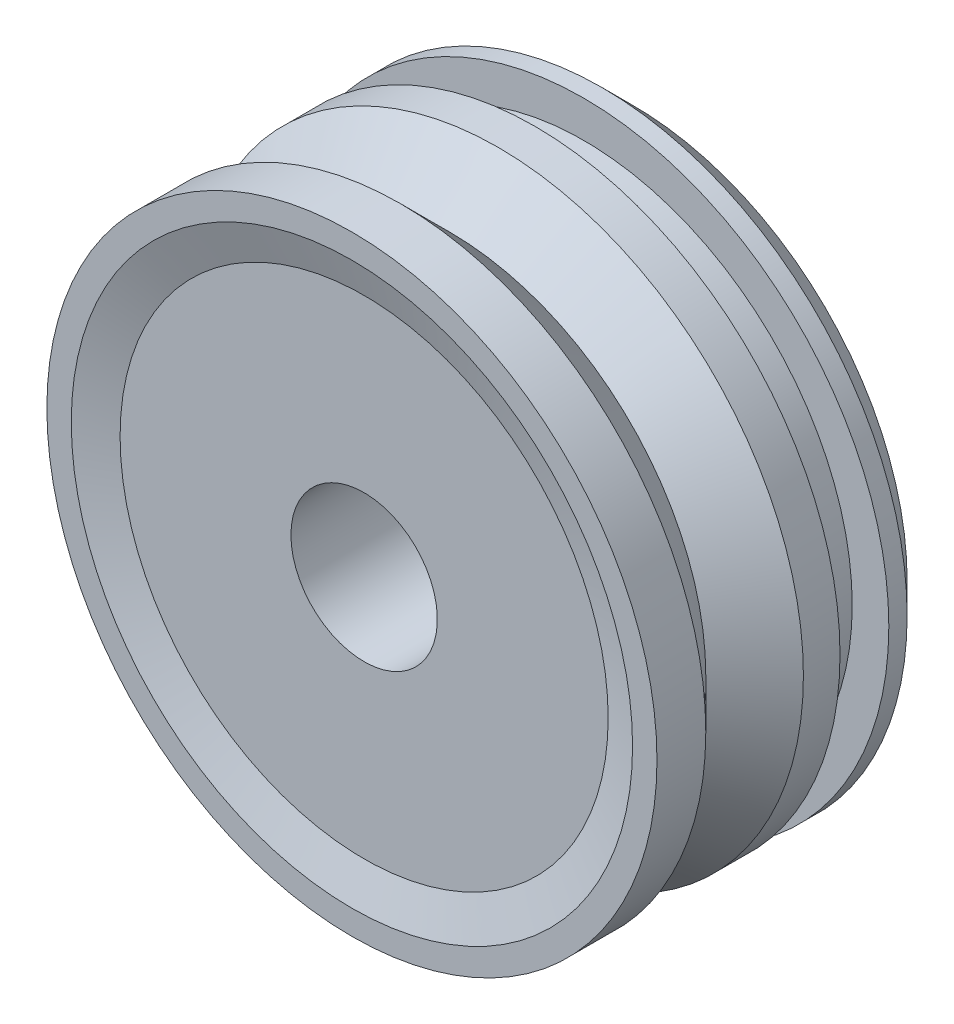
ISO-10303-21;
HEADER;
FILE_DESCRIPTION(('STEP AP214'),'2;1');
FILE_NAME('part.step','',(''),(''),'','','');
FILE_SCHEMA(('AUTOMOTIVE_DESIGN { 1 0 10303 214 1 1 1 1 }'));
ENDSEC;
DATA;
#1=APPLICATION_CONTEXT('core data for automotive mechanical design processes');
#2=APPLICATION_PROTOCOL_DEFINITION('international standard','automotive_design',2000,#1);
#3=PRODUCT_CONTEXT('',#1,'mechanical');
#4=PRODUCT('Part','Part','',(#3));
#5=PRODUCT_RELATED_PRODUCT_CATEGORY('part','',(#4));
#6=PRODUCT_DEFINITION_FORMATION('','',#4);
#7=PRODUCT_DEFINITION_CONTEXT('part definition',#1,'design');
#8=PRODUCT_DEFINITION('design','',#6,#7);
#9=PRODUCT_DEFINITION_SHAPE('','',#8);
#10=(LENGTH_UNIT() NAMED_UNIT(*) SI_UNIT(.MILLI.,.METRE.));
#11=(NAMED_UNIT(*) PLANE_ANGLE_UNIT() SI_UNIT($,.RADIAN.));
#12=(NAMED_UNIT(*) SI_UNIT($,.STERADIAN.) SOLID_ANGLE_UNIT());
#13=UNCERTAINTY_MEASURE_WITH_UNIT(LENGTH_MEASURE(1.E-05),#10,'distance_accuracy_value','');
#14=(GEOMETRIC_REPRESENTATION_CONTEXT(3) GLOBAL_UNCERTAINTY_ASSIGNED_CONTEXT((#13)) GLOBAL_UNIT_ASSIGNED_CONTEXT((#10,
#11,#12)) REPRESENTATION_CONTEXT('',''));
#15=CARTESIAN_POINT('',(0.,0.,0.));
#16=DIRECTION('',(0.,0.,1.));
#17=DIRECTION('',(1.,0.,0.));
#18=AXIS2_PLACEMENT_3D('',#15,#16,#17);
#19=CARTESIAN_POINT('',(0.,0.,11.5));
#20=DIRECTION('',(0.,0.,-1.));
#21=DIRECTION('',(-1.,0.,0.));
#22=AXIS2_PLACEMENT_3D('',#19,#20,#21);
#23=CYLINDRICAL_SURFACE('',#22,12.5);
#24=CARTESIAN_POINT('',(0.,0.,5.50000000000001));
#25=DIRECTION('',(0.,0.,-1.));
#26=DIRECTION('',(-1.,0.,0.));
#27=AXIS2_PLACEMENT_3D('',#24,#25,#26);
#28=CIRCLE('',#27,12.5);
#29=CARTESIAN_POINT('',(-12.5,0.,5.50000000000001));
#30=VERTEX_POINT('',#29);
#31=EDGE_CURVE('E70',#30,#30,#28,.T.);
#32=CARTESIAN_POINT('',(0.,0.,4.));
#33=DIRECTION('',(0.,0.,-1.));
#34=DIRECTION('',(-1.,0.,0.));
#35=AXIS2_PLACEMENT_3D('',#32,#33,#34);
#36=CIRCLE('',#35,12.5);
#37=CARTESIAN_POINT('',(-12.5,0.,4.));
#38=VERTEX_POINT('',#37);
#39=EDGE_CURVE('E55',#38,#38,#36,.T.);
#40=CARTESIAN_POINT('',(-12.5,0.,5.50000000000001));
#41=CARTESIAN_POINT('',(-12.5,0.,5.484375));
#42=CARTESIAN_POINT('',(-12.5,0.,5.46875));
#43=CARTESIAN_POINT('',(-12.5,0.,5.4375));
#44=CARTESIAN_POINT('',(-12.5,0.,5.421875));
#45=CARTESIAN_POINT('',(-12.5,0.,5.390625));
#46=CARTESIAN_POINT('',(-12.5,0.,5.375));
#47=CARTESIAN_POINT('',(-12.5,0.,5.34375));
#48=CARTESIAN_POINT('',(-12.5,0.,5.328125));
#49=CARTESIAN_POINT('',(-12.5,0.,5.296875));
#50=CARTESIAN_POINT('',(-12.5,0.,5.28125));
#51=CARTESIAN_POINT('',(-12.5,0.,5.25));
#52=CARTESIAN_POINT('',(-12.5,0.,5.234375));
#53=CARTESIAN_POINT('',(-12.5,0.,5.203125));
#54=CARTESIAN_POINT('',(-12.5,0.,5.1875));
#55=CARTESIAN_POINT('',(-12.5,0.,5.15625));
#56=CARTESIAN_POINT('',(-12.5,0.,5.140625));
#57=CARTESIAN_POINT('',(-12.5,0.,5.109375));
#58=CARTESIAN_POINT('',(-12.5,0.,5.09375));
#59=CARTESIAN_POINT('',(-12.5,0.,5.0625));
#60=CARTESIAN_POINT('',(-12.5,0.,5.046875));
#61=CARTESIAN_POINT('',(-12.5,0.,5.015625));
#62=CARTESIAN_POINT('',(-12.5,0.,5.));
#63=CARTESIAN_POINT('',(-12.5,0.,4.96875));
#64=CARTESIAN_POINT('',(-12.5,0.,4.953125));
#65=CARTESIAN_POINT('',(-12.5,0.,4.921875));
#66=CARTESIAN_POINT('',(-12.5,0.,4.90625));
#67=CARTESIAN_POINT('',(-12.5,0.,4.875));
#68=CARTESIAN_POINT('',(-12.5,0.,4.859375));
#69=CARTESIAN_POINT('',(-12.5,0.,4.828125));
#70=CARTESIAN_POINT('',(-12.5,0.,4.8125));
#71=CARTESIAN_POINT('',(-12.5,0.,4.78125));
#72=CARTESIAN_POINT('',(-12.5,0.,4.765625));
#73=CARTESIAN_POINT('',(-12.5,0.,4.734375));
#74=CARTESIAN_POINT('',(-12.5,0.,4.71875));
#75=CARTESIAN_POINT('',(-12.5,0.,4.6875));
#76=CARTESIAN_POINT('',(-12.5,0.,4.671875));
#77=CARTESIAN_POINT('',(-12.5,0.,4.640625));
#78=CARTESIAN_POINT('',(-12.5,0.,4.625));
#79=CARTESIAN_POINT('',(-12.5,0.,4.59375));
#80=CARTESIAN_POINT('',(-12.5,0.,4.578125));
#81=CARTESIAN_POINT('',(-12.5,0.,4.546875));
#82=CARTESIAN_POINT('',(-12.5,0.,4.53125));
#83=CARTESIAN_POINT('',(-12.5,0.,4.5));
#84=CARTESIAN_POINT('',(-12.5,0.,4.484375));
#85=CARTESIAN_POINT('',(-12.5,0.,4.453125));
#86=CARTESIAN_POINT('',(-12.5,0.,4.4375));
#87=CARTESIAN_POINT('',(-12.5,0.,4.40625));
#88=CARTESIAN_POINT('',(-12.5,0.,4.390625));
#89=CARTESIAN_POINT('',(-12.5,0.,4.359375));
#90=CARTESIAN_POINT('',(-12.5,0.,4.34375));
#91=CARTESIAN_POINT('',(-12.5,0.,4.3125));
#92=CARTESIAN_POINT('',(-12.5,0.,4.296875));
#93=CARTESIAN_POINT('',(-12.5,0.,4.265625));
#94=CARTESIAN_POINT('',(-12.5,0.,4.25));
#95=CARTESIAN_POINT('',(-12.5,0.,4.21875));
#96=CARTESIAN_POINT('',(-12.5,0.,4.203125));
#97=CARTESIAN_POINT('',(-12.5,0.,4.171875));
#98=CARTESIAN_POINT('',(-12.5,0.,4.15625));
#99=CARTESIAN_POINT('',(-12.5,0.,4.125));
#100=CARTESIAN_POINT('',(-12.5,0.,4.109375));
#101=CARTESIAN_POINT('',(-12.5,0.,4.078125));
#102=CARTESIAN_POINT('',(-12.5,0.,4.0625));
#103=CARTESIAN_POINT('',(-12.5,0.,4.03125));
#104=CARTESIAN_POINT('',(-12.5,0.,4.015625));
#105=CARTESIAN_POINT('',(-12.5,0.,4.));
#106=B_SPLINE_CURVE_WITH_KNOTS('',3,(#40,#41,#42,#43,#44,#45,#46,#47,#48,#49,#50,#51,#52,#53,
#54,#55,#56,#57,#58,#59,#60,#61,#62,#63,#64,#65,#66,#67,#68,#69,#70,#71,#72,#73,#74,#75,#76,#77,
#78,#79,#80,#81,#82,#83,#84,#85,#86,#87,#88,#89,#90,#91,#92,#93,#94,#95,#96,#97,#98,#99,#100,
#101,#102,#103,#104,#105),.UNSPECIFIED.,.F.,.F.,(4,2,2,2,2,2,2,2,2,2,2,2,2,2,2,2,2,2,2,2,2,2,2,
2,2,2,2,2,2,2,2,2,4),(0.,0.046875,0.0937500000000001,0.140625,0.1875,0.234375,0.28125,0.328125,
0.375,0.421875,0.46875,0.515625,0.5625,0.609375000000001,0.656250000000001,0.703125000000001,
0.750000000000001,0.796875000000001,0.843750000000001,0.890625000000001,0.937500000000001,
0.984375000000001,1.03125,1.078125,1.125,1.171875,1.21875,1.265625,1.3125,1.359375,1.40625,
1.453125,1.5),.UNSPECIFIED.);
#107=EDGE_CURVE('BSEAM26',#30,#38,#106,.T.);
#108=ORIENTED_EDGE('',*,*,#31,.T.);
#109=ORIENTED_EDGE('',*,*,#39,.F.);
#110=ORIENTED_EDGE('',*,*,#107,.T.);
#111=ORIENTED_EDGE('',*,*,#107,.F.);
#112=EDGE_LOOP('',(#108,#110,#109,#111));
#113=FACE_BOUND('',#112,.T.);
#114=ADVANCED_FACE('F26',(#113),#23,.T.);
#115=CARTESIAN_POINT('',(-12.5,0.,4.));
#116=DIRECTION('',(0.,0.,1.));
#117=DIRECTION('',(1.,0.,0.));
#118=AXIS2_PLACEMENT_3D('',#115,#116,#117);
#119=PLANE('',#118);
#120=CARTESIAN_POINT('',(0.,0.,4.));
#121=DIRECTION('',(0.,0.,-1.));
#122=DIRECTION('',(-1.,0.,0.));
#123=AXIS2_PLACEMENT_3D('',#120,#121,#122);
#124=CIRCLE('',#123,11.);
#125=CARTESIAN_POINT('',(-11.,0.,4.));
#126=VERTEX_POINT('',#125);
#127=EDGE_CURVE('E58',#126,#126,#124,.T.);
#128=ORIENTED_EDGE('',*,*,#127,.F.);
#129=EDGE_LOOP('',(#128));
#130=FACE_BOUND('',#129,.T.);
#131=ORIENTED_EDGE('',*,*,#39,.T.);
#132=EDGE_LOOP('',(#131));
#133=FACE_BOUND('',#132,.T.);
#134=ADVANCED_FACE('F114',(#130,#133),#119,.F.);
#135=CARTESIAN_POINT('',(0.,0.,-3.39865377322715));
#136=DIRECTION('',(0.,0.,-1.));
#137=DIRECTION('',(-1.,0.,0.));
#138=AXIS2_PLACEMENT_3D('',#135,#136,#137);
#139=CYLINDRICAL_SURFACE('',#138,11.);
#140=CARTESIAN_POINT('',(0.,0.,2.));
#141=DIRECTION('',(0.,0.,-1.));
#142=DIRECTION('',(-1.,0.,0.));
#143=AXIS2_PLACEMENT_3D('',#140,#141,#142);
#144=CIRCLE('',#143,11.);
#145=CARTESIAN_POINT('',(-11.,0.,2.));
#146=VERTEX_POINT('',#145);
#147=EDGE_CURVE('E61',#146,#146,#144,.T.);
#148=CARTESIAN_POINT('',(-11.,0.,2.));
#149=CARTESIAN_POINT('',(-11.,0.,2.02083333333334));
#150=CARTESIAN_POINT('',(-11.,0.,2.04166666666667));
#151=CARTESIAN_POINT('',(-11.,0.,2.08333333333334));
#152=CARTESIAN_POINT('',(-11.,0.,2.10416666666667));
#153=CARTESIAN_POINT('',(-11.,0.,2.14583333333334));
#154=CARTESIAN_POINT('',(-11.,0.,2.16666666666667));
#155=CARTESIAN_POINT('',(-11.,0.,2.20833333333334));
#156=CARTESIAN_POINT('',(-11.,0.,2.22916666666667));
#157=CARTESIAN_POINT('',(-11.,0.,2.27083333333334));
#158=CARTESIAN_POINT('',(-11.,0.,2.29166666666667));
#159=CARTESIAN_POINT('',(-11.,0.,2.33333333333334));
#160=CARTESIAN_POINT('',(-11.,0.,2.35416666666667));
#161=CARTESIAN_POINT('',(-11.,0.,2.39583333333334));
#162=CARTESIAN_POINT('',(-11.,0.,2.41666666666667));
#163=CARTESIAN_POINT('',(-11.,0.,2.45833333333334));
#164=CARTESIAN_POINT('',(-11.,0.,2.47916666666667));
#165=CARTESIAN_POINT('',(-11.,0.,2.52083333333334));
#166=CARTESIAN_POINT('',(-11.,0.,2.54166666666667));
#167=CARTESIAN_POINT('',(-11.,0.,2.58333333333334));
#168=CARTESIAN_POINT('',(-11.,0.,2.60416666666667));
#169=CARTESIAN_POINT('',(-11.,0.,2.64583333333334));
#170=CARTESIAN_POINT('',(-11.,0.,2.66666666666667));
#171=CARTESIAN_POINT('',(-11.,0.,2.70833333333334));
#172=CARTESIAN_POINT('',(-11.,0.,2.72916666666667));
#173=CARTESIAN_POINT('',(-11.,0.,2.77083333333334));
#174=CARTESIAN_POINT('',(-11.,0.,2.79166666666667));
#175=CARTESIAN_POINT('',(-11.,0.,2.83333333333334));
#176=CARTESIAN_POINT('',(-11.,0.,2.85416666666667));
#177=CARTESIAN_POINT('',(-11.,0.,2.89583333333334));
#178=CARTESIAN_POINT('',(-11.,0.,2.91666666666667));
#179=CARTESIAN_POINT('',(-11.,0.,2.95833333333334));
#180=CARTESIAN_POINT('',(-11.,0.,2.97916666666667));
#181=CARTESIAN_POINT('',(-11.,0.,3.02083333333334));
#182=CARTESIAN_POINT('',(-11.,0.,3.04166666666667));
#183=CARTESIAN_POINT('',(-11.,0.,3.08333333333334));
#184=CARTESIAN_POINT('',(-11.,0.,3.10416666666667));
#185=CARTESIAN_POINT('',(-11.,0.,3.14583333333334));
#186=CARTESIAN_POINT('',(-11.,0.,3.16666666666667));
#187=CARTESIAN_POINT('',(-11.,0.,3.20833333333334));
#188=CARTESIAN_POINT('',(-11.,0.,3.22916666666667));
#189=CARTESIAN_POINT('',(-11.,0.,3.27083333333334));
#190=CARTESIAN_POINT('',(-11.,0.,3.29166666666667));
#191=CARTESIAN_POINT('',(-11.,0.,3.33333333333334));
#192=CARTESIAN_POINT('',(-11.,0.,3.35416666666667));
#193=CARTESIAN_POINT('',(-11.,0.,3.39583333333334));
#194=CARTESIAN_POINT('',(-11.,0.,3.41666666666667));
#195=CARTESIAN_POINT('',(-11.,0.,3.45833333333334));
#196=CARTESIAN_POINT('',(-11.,0.,3.47916666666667));
#197=CARTESIAN_POINT('',(-11.,0.,3.52083333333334));
#198=CARTESIAN_POINT('',(-11.,0.,3.54166666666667));
#199=CARTESIAN_POINT('',(-11.,0.,3.58333333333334));
#200=CARTESIAN_POINT('',(-11.,0.,3.60416666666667));
#201=CARTESIAN_POINT('',(-11.,0.,3.64583333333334));
#202=CARTESIAN_POINT('',(-11.,0.,3.66666666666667));
#203=CARTESIAN_POINT('',(-11.,0.,3.70833333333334));
#204=CARTESIAN_POINT('',(-11.,0.,3.72916666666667));
#205=CARTESIAN_POINT('',(-11.,0.,3.77083333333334));
#206=CARTESIAN_POINT('',(-11.,0.,3.79166666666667));
#207=CARTESIAN_POINT('',(-11.,0.,3.83333333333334));
#208=CARTESIAN_POINT('',(-11.,0.,3.85416666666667));
#209=CARTESIAN_POINT('',(-11.,0.,3.89583333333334));
#210=CARTESIAN_POINT('',(-11.,0.,3.91666666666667));
#211=CARTESIAN_POINT('',(-11.,0.,3.95833333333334));
#212=CARTESIAN_POINT('',(-11.,0.,3.97916666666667));
#213=CARTESIAN_POINT('',(-11.,0.,4.));
#214=B_SPLINE_CURVE_WITH_KNOTS('',3,(#148,#149,#150,#151,#152,#153,#154,#155,#156,#157,#158,
#159,#160,#161,#162,#163,#164,#165,#166,#167,#168,#169,#170,#171,#172,#173,#174,#175,#176,#177,
#178,#179,#180,#181,#182,#183,#184,#185,#186,#187,#188,#189,#190,#191,#192,#193,#194,#195,#196,
#197,#198,#199,#200,#201,#202,#203,#204,#205,#206,#207,#208,#209,#210,#211,#212,#213),
.UNSPECIFIED.,.F.,.F.,(4,2,2,2,2,2,2,2,2,2,2,2,2,2,2,2,2,2,2,2,2,2,2,2,2,2,2,2,2,2,2,2,4),(0.,
0.0625000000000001,0.125,0.1875,0.25,0.3125,0.375,0.4375,0.5,0.5625,0.625,0.6875,0.75,0.8125,
0.875,0.9375,1.,1.0625,1.125,1.1875,1.25,1.3125,1.375,1.4375,1.5,1.5625,1.625,1.6875,1.75,
1.8125,1.875,1.9375,2.),.UNSPECIFIED.);
#215=EDGE_CURVE('BSEAM120',#146,#126,#214,.T.);
#216=ORIENTED_EDGE('',*,*,#147,.F.);
#217=ORIENTED_EDGE('',*,*,#127,.T.);
#218=ORIENTED_EDGE('',*,*,#215,.T.);
#219=ORIENTED_EDGE('',*,*,#215,.F.);
#220=EDGE_LOOP('',(#216,#218,#217,#219));
#221=FACE_BOUND('',#220,.T.);
#222=ADVANCED_FACE('F120',(#221),#139,.T.);
#223=CARTESIAN_POINT('',(-12.5,0.,2.));
#224=DIRECTION('',(0.,0.,-1.));
#225=DIRECTION('',(-1.,0.,0.));
#226=AXIS2_PLACEMENT_3D('',#223,#224,#225);
#227=PLANE('',#226);
#228=CARTESIAN_POINT('',(0.,0.,2.));
#229=DIRECTION('',(0.,0.,-1.));
#230=DIRECTION('',(-1.,0.,0.));
#231=AXIS2_PLACEMENT_3D('',#228,#229,#230);
#232=CIRCLE('',#231,12.5);
#233=CARTESIAN_POINT('',(-12.5,0.,2.));
#234=VERTEX_POINT('',#233);
#235=EDGE_CURVE('E64',#234,#234,#232,.T.);
#236=ORIENTED_EDGE('',*,*,#235,.F.);
#237=EDGE_LOOP('',(#236));
#238=FACE_BOUND('',#237,.T.);
#239=ORIENTED_EDGE('',*,*,#147,.T.);
#240=EDGE_LOOP('',(#239));
#241=FACE_BOUND('',#240,.T.);
#242=ADVANCED_FACE('F111',(#238,#241),#227,.F.);
#243=CARTESIAN_POINT('',(0.,0.,0.));
#244=DIRECTION('',(0.,0.,1.));
#245=DIRECTION('',(1.,0.,0.));
#246=AXIS2_PLACEMENT_3D('',#243,#244,#245);
#247=PLANE('',#246);
#248=CARTESIAN_POINT('',(0.,0.,0.));
#249=DIRECTION('',(0.,0.,-1.));
#250=DIRECTION('',(-1.,0.,0.));
#251=AXIS2_PLACEMENT_3D('',#248,#249,#250);
#252=CIRCLE('',#251,9.5);
#253=CARTESIAN_POINT('',(-9.50000000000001,0.,0.));
#254=VERTEX_POINT('',#253);
#255=EDGE_CURVE('E79',#254,#254,#252,.T.);
#256=ORIENTED_EDGE('',*,*,#255,.F.);
#257=EDGE_LOOP('',(#256));
#258=FACE_BOUND('',#257,.T.);
#259=CARTESIAN_POINT('',(0.,0.,0.));
#260=DIRECTION('',(0.,0.,1.));
#261=DIRECTION('',(1.,0.,0.));
#262=AXIS2_PLACEMENT_3D('',#259,#260,#261);
#263=CIRCLE('',#262,11.25);
#264=CARTESIAN_POINT('',(11.25,0.,0.));
#265=VERTEX_POINT('',#264);
#266=EDGE_CURVE('E37',#265,#265,#263,.F.);
#267=ORIENTED_EDGE('',*,*,#266,.T.);
#268=EDGE_LOOP('',(#267));
#269=FACE_BOUND('',#268,.T.);
#270=ADVANCED_FACE('F99',(#258,#269),#247,.F.);
#271=CARTESIAN_POINT('',(0.,0.,1.25));
#272=DIRECTION('',(0.,0.,1.));
#273=DIRECTION('',(1.,0.,0.));
#274=AXIS2_PLACEMENT_3D('',#271,#272,#273);
#275=CONICAL_SURFACE('',#274,12.5,0.78539816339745);
#276=CARTESIAN_POINT('',(0.,0.,1.25));
#277=DIRECTION('',(0.,0.,1.));
#278=DIRECTION('',(1.,0.,0.));
#279=AXIS2_PLACEMENT_3D('',#276,#277,#278);
#280=CIRCLE('',#279,12.5);
#281=CARTESIAN_POINT('',(12.5,0.,1.25));
#282=VERTEX_POINT('',#281);
#283=EDGE_CURVE('E41',#282,#282,#280,.T.);
#284=CARTESIAN_POINT('',(11.25,0.,0.));
#285=CARTESIAN_POINT('',(11.2630208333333,0.,0.0130208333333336));
#286=CARTESIAN_POINT('',(11.2760416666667,0.,0.0260416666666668));
#287=CARTESIAN_POINT('',(11.3020833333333,0.,0.0520833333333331));
#288=CARTESIAN_POINT('',(11.3151041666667,0.,0.0651041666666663));
#289=CARTESIAN_POINT('',(11.3411458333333,0.,0.0911458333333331));
#290=CARTESIAN_POINT('',(11.3541666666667,0.,0.104166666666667));
#291=CARTESIAN_POINT('',(11.3802083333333,0.,0.130208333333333));
#292=CARTESIAN_POINT('',(11.3932291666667,0.,0.143229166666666));
#293=CARTESIAN_POINT('',(11.4192708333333,0.,0.169270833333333));
#294=CARTESIAN_POINT('',(11.4322916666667,0.,0.182291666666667));
#295=CARTESIAN_POINT('',(11.4583333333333,0.,0.208333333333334));
#296=CARTESIAN_POINT('',(11.4713541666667,0.,0.221354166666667));
#297=CARTESIAN_POINT('',(11.4973958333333,0.,0.247395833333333));
#298=CARTESIAN_POINT('',(11.5104166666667,0.,0.260416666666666));
#299=CARTESIAN_POINT('',(11.5364583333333,0.,0.286458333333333));
#300=CARTESIAN_POINT('',(11.5494791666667,0.,0.299479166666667));
#301=CARTESIAN_POINT('',(11.5755208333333,0.,0.325520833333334));
#302=CARTESIAN_POINT('',(11.5885416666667,0.,0.338541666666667));
#303=CARTESIAN_POINT('',(11.6145833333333,0.,0.364583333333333));
#304=CARTESIAN_POINT('',(11.6276041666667,0.,0.377604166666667));
#305=CARTESIAN_POINT('',(11.6536458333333,0.,0.403645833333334));
#306=CARTESIAN_POINT('',(11.6666666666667,0.,0.416666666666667));
#307=CARTESIAN_POINT('',(11.6927083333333,0.,0.442708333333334));
#308=CARTESIAN_POINT('',(11.7057291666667,0.,0.455729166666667));
#309=CARTESIAN_POINT('',(11.7317708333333,0.,0.481770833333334));
#310=CARTESIAN_POINT('',(11.7447916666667,0.,0.494791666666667));
#311=CARTESIAN_POINT('',(11.7708333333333,0.,0.520833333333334));
#312=CARTESIAN_POINT('',(11.7838541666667,0.,0.533854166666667));
#313=CARTESIAN_POINT('',(11.8098958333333,0.,0.559895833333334));
#314=CARTESIAN_POINT('',(11.8229166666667,0.,0.572916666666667));
#315=CARTESIAN_POINT('',(11.8489583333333,0.,0.598958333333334));
#316=CARTESIAN_POINT('',(11.8619791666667,0.,0.611979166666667));
#317=CARTESIAN_POINT('',(11.8880208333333,0.,0.638020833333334));
#318=CARTESIAN_POINT('',(11.9010416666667,0.,0.651041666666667));
#319=CARTESIAN_POINT('',(11.9270833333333,0.,0.677083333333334));
#320=CARTESIAN_POINT('',(11.9401041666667,0.,0.690104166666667));
#321=CARTESIAN_POINT('',(11.9661458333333,0.,0.716145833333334));
#322=CARTESIAN_POINT('',(11.9791666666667,0.,0.729166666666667));
#323=CARTESIAN_POINT('',(12.0052083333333,0.,0.755208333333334));
#324=CARTESIAN_POINT('',(12.0182291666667,0.,0.768229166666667));
#325=CARTESIAN_POINT('',(12.0442708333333,0.,0.794270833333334));
#326=CARTESIAN_POINT('',(12.0572916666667,0.,0.807291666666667));
#327=CARTESIAN_POINT('',(12.0833333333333,0.,0.833333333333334));
#328=CARTESIAN_POINT('',(12.0963541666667,0.,0.846354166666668));
#329=CARTESIAN_POINT('',(12.1223958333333,0.,0.872395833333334));
#330=CARTESIAN_POINT('',(12.1354166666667,0.,0.885416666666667));
#331=CARTESIAN_POINT('',(12.1614583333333,0.,0.911458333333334));
#332=CARTESIAN_POINT('',(12.1744791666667,0.,0.924479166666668));
#333=CARTESIAN_POINT('',(12.2005208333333,0.,0.950520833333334));
#334=CARTESIAN_POINT('',(12.2135416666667,0.,0.963541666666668));
#335=CARTESIAN_POINT('',(12.2395833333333,0.,0.989583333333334));
#336=CARTESIAN_POINT('',(12.2526041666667,0.,1.00260416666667));
#337=CARTESIAN_POINT('',(12.2786458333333,0.,1.02864583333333));
#338=CARTESIAN_POINT('',(12.2916666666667,0.,1.04166666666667));
#339=CARTESIAN_POINT('',(12.3177083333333,0.,1.06770833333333));
#340=CARTESIAN_POINT('',(12.3307291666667,0.,1.08072916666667));
#341=CARTESIAN_POINT('',(12.3567708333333,0.,1.10677083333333));
#342=CARTESIAN_POINT('',(12.3697916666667,0.,1.11979166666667));
#343=CARTESIAN_POINT('',(12.3958333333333,0.,1.14583333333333));
#344=CARTESIAN_POINT('',(12.4088541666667,0.,1.15885416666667));
#345=CARTESIAN_POINT('',(12.4348958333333,0.,1.18489583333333));
#346=CARTESIAN_POINT('',(12.4479166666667,0.,1.19791666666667));
#347=CARTESIAN_POINT('',(12.4739583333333,0.,1.22395833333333));
#348=CARTESIAN_POINT('',(12.4869791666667,0.,1.23697916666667));
#349=CARTESIAN_POINT('',(12.5,0.,1.25));
#350=B_SPLINE_CURVE_WITH_KNOTS('',3,(#284,#285,#286,#287,#288,#289,#290,#291,#292,#293,#294,
#295,#296,#297,#298,#299,#300,#301,#302,#303,#304,#305,#306,#307,#308,#309,#310,#311,#312,#313,
#314,#315,#316,#317,#318,#319,#320,#321,#322,#323,#324,#325,#326,#327,#328,#329,#330,#331,#332,
#333,#334,#335,#336,#337,#338,#339,#340,#341,#342,#343,#344,#345,#346,#347,#348,#349),
.UNSPECIFIED.,.F.,.F.,(4,2,2,2,2,2,2,2,2,2,2,2,2,2,2,2,2,2,2,2,2,2,2,2,2,2,2,2,2,2,2,2,4),(0.,
0.0552427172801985,0.110485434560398,0.165728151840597,0.220970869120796,0.276213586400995,
0.331456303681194,0.386699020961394,0.441941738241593,0.497184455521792,0.552427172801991,
0.607669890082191,0.66291260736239,0.71815532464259,0.77339804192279,0.828640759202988,
0.883883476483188,0.939126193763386,0.994368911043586,1.04961162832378,1.10485434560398,
1.16009706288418,1.21533978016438,1.27058249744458,1.32582521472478,1.38106793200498,
1.43631064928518,1.49155336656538,1.54679608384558,1.60203880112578,1.65728151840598,
1.71252423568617,1.76776695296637),.UNSPECIFIED.);
#351=EDGE_CURVE('BSEAM110',#265,#282,#350,.T.);
#352=ORIENTED_EDGE('',*,*,#266,.F.);
#353=ORIENTED_EDGE('',*,*,#283,.F.);
#354=ORIENTED_EDGE('',*,*,#351,.T.);
#355=ORIENTED_EDGE('',*,*,#351,.F.);
#356=EDGE_LOOP('',(#352,#354,#353,#355));
#357=FACE_BOUND('',#356,.T.);
#358=ADVANCED_FACE('F110',(#357),#275,.T.);
#359=ORIENTED_EDGE('',*,*,#235,.T.);
#360=EDGE_LOOP('',(#359));
#361=FACE_BOUND('',#360,.T.);
#362=ORIENTED_EDGE('',*,*,#283,.T.);
#363=EDGE_LOOP('',(#362));
#364=FACE_BOUND('',#363,.T.);
#365=ADVANCED_FACE('F28',(#361,#364),#23,.T.);
#366=CARTESIAN_POINT('',(0.,0.,9.50000000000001));
#367=DIRECTION('',(0.,0.,1.));
#368=DIRECTION('',(1.,0.,0.));
#369=AXIS2_PLACEMENT_3D('',#366,#367,#368);
#370=CONICAL_SURFACE('',#369,12.5,0.785398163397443);
#371=CARTESIAN_POINT('',(0.,0.,7.49999999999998));
#372=DIRECTION('',(0.,0.,-1.));
#373=DIRECTION('',(-1.,0.,0.));
#374=AXIS2_PLACEMENT_3D('',#371,#372,#373);
#375=CIRCLE('',#374,10.5);
#376=CARTESIAN_POINT('',(10.5,0.,7.49999999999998));
#377=VERTEX_POINT('',#376);
#378=EDGE_CURVE('E67',#377,#377,#375,.T.);
#379=CARTESIAN_POINT('',(0.,0.,9.50000000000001));
#380=DIRECTION('',(0.,0.,-1.));
#381=DIRECTION('',(-1.,0.,0.));
#382=AXIS2_PLACEMENT_3D('',#379,#380,#381);
#383=CIRCLE('',#382,12.5);
#384=CARTESIAN_POINT('',(12.5,0.,9.50000000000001));
#385=VERTEX_POINT('',#384);
#386=EDGE_CURVE('E73',#385,#385,#383,.T.);
#387=CARTESIAN_POINT('',(10.5,0.,7.49999999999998));
#388=CARTESIAN_POINT('',(10.5208333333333,0.,7.52083333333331));
#389=CARTESIAN_POINT('',(10.5416666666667,0.,7.54166666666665));
#390=CARTESIAN_POINT('',(10.5833333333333,0.,7.58333333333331));
#391=CARTESIAN_POINT('',(10.6041666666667,0.,7.60416666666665));
#392=CARTESIAN_POINT('',(10.6458333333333,0.,7.64583333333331));
#393=CARTESIAN_POINT('',(10.6666666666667,0.,7.66666666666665));
#394=CARTESIAN_POINT('',(10.7083333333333,0.,7.70833333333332));
#395=CARTESIAN_POINT('',(10.7291666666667,0.,7.72916666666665));
#396=CARTESIAN_POINT('',(10.7708333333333,0.,7.77083333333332));
#397=CARTESIAN_POINT('',(10.7916666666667,0.,7.79166666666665));
#398=CARTESIAN_POINT('',(10.8333333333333,0.,7.83333333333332));
#399=CARTESIAN_POINT('',(10.8541666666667,0.,7.85416666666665));
#400=CARTESIAN_POINT('',(10.8958333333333,0.,7.89583333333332));
#401=CARTESIAN_POINT('',(10.9166666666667,0.,7.91666666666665));
#402=CARTESIAN_POINT('',(10.9583333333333,0.,7.95833333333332));
#403=CARTESIAN_POINT('',(10.9791666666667,0.,7.97916666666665));
#404=CARTESIAN_POINT('',(11.0208333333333,0.,8.02083333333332));
#405=CARTESIAN_POINT('',(11.0416666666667,0.,8.04166666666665));
#406=CARTESIAN_POINT('',(11.0833333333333,0.,8.08333333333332));
#407=CARTESIAN_POINT('',(11.1041666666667,0.,8.10416666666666));
#408=CARTESIAN_POINT('',(11.1458333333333,0.,8.14583333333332));
#409=CARTESIAN_POINT('',(11.1666666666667,0.,8.16666666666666));
#410=CARTESIAN_POINT('',(11.2083333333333,0.,8.20833333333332));
#411=CARTESIAN_POINT('',(11.2291666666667,0.,8.22916666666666));
#412=CARTESIAN_POINT('',(11.2708333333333,0.,8.27083333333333));
#413=CARTESIAN_POINT('',(11.2916666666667,0.,8.29166666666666));
#414=CARTESIAN_POINT('',(11.3333333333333,0.,8.33333333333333));
#415=CARTESIAN_POINT('',(11.3541666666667,0.,8.35416666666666));
#416=CARTESIAN_POINT('',(11.3958333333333,0.,8.39583333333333));
#417=CARTESIAN_POINT('',(11.4166666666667,0.,8.41666666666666));
#418=CARTESIAN_POINT('',(11.4583333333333,0.,8.45833333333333));
#419=CARTESIAN_POINT('',(11.4791666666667,0.,8.47916666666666));
#420=CARTESIAN_POINT('',(11.5208333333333,0.,8.52083333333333));
#421=CARTESIAN_POINT('',(11.5416666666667,0.,8.54166666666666));
#422=CARTESIAN_POINT('',(11.5833333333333,0.,8.58333333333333));
#423=CARTESIAN_POINT('',(11.6041666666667,0.,8.60416666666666));
#424=CARTESIAN_POINT('',(11.6458333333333,0.,8.64583333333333));
#425=CARTESIAN_POINT('',(11.6666666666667,0.,8.66666666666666));
#426=CARTESIAN_POINT('',(11.7083333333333,0.,8.70833333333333));
#427=CARTESIAN_POINT('',(11.7291666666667,0.,8.72916666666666));
#428=CARTESIAN_POINT('',(11.7708333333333,0.,8.77083333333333));
#429=CARTESIAN_POINT('',(11.7916666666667,0.,8.79166666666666));
#430=CARTESIAN_POINT('',(11.8333333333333,0.,8.83333333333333));
#431=CARTESIAN_POINT('',(11.8541666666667,0.,8.85416666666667));
#432=CARTESIAN_POINT('',(11.8958333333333,0.,8.89583333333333));
#433=CARTESIAN_POINT('',(11.9166666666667,0.,8.91666666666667));
#434=CARTESIAN_POINT('',(11.9583333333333,0.,8.95833333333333));
#435=CARTESIAN_POINT('',(11.9791666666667,0.,8.97916666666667));
#436=CARTESIAN_POINT('',(12.0208333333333,0.,9.02083333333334));
#437=CARTESIAN_POINT('',(12.0416666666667,0.,9.04166666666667));
#438=CARTESIAN_POINT('',(12.0833333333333,0.,9.08333333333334));
#439=CARTESIAN_POINT('',(12.1041666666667,0.,9.10416666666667));
#440=CARTESIAN_POINT('',(12.1458333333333,0.,9.14583333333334));
#441=CARTESIAN_POINT('',(12.1666666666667,0.,9.16666666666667));
#442=CARTESIAN_POINT('',(12.2083333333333,0.,9.20833333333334));
#443=CARTESIAN_POINT('',(12.2291666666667,0.,9.22916666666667));
#444=CARTESIAN_POINT('',(12.2708333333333,0.,9.27083333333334));
#445=CARTESIAN_POINT('',(12.2916666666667,0.,9.29166666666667));
#446=CARTESIAN_POINT('',(12.3333333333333,0.,9.33333333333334));
#447=CARTESIAN_POINT('',(12.3541666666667,0.,9.35416666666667));
#448=CARTESIAN_POINT('',(12.3958333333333,0.,9.39583333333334));
#449=CARTESIAN_POINT('',(12.4166666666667,0.,9.41666666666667));
#450=CARTESIAN_POINT('',(12.4583333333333,0.,9.45833333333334));
#451=CARTESIAN_POINT('',(12.4791666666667,0.,9.47916666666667));
#452=CARTESIAN_POINT('',(12.5,0.,9.50000000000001));
#453=B_SPLINE_CURVE_WITH_KNOTS('',3,(#387,#388,#389,#390,#391,#392,#393,#394,#395,#396,#397,
#398,#399,#400,#401,#402,#403,#404,#405,#406,#407,#408,#409,#410,#411,#412,#413,#414,#415,#416,
#417,#418,#419,#420,#421,#422,#423,#424,#425,#426,#427,#428,#429,#430,#431,#432,#433,#434,#435,
#436,#437,#438,#439,#440,#441,#442,#443,#444,#445,#446,#447,#448,#449,#450,#451,#452),
.UNSPECIFIED.,.F.,.F.,(4,2,2,2,2,2,2,2,2,2,2,2,2,2,2,2,2,2,2,2,2,2,2,2,2,2,2,2,2,2,2,2,4),(0.,
0.0883883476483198,0.176776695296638,0.265165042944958,0.353553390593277,0.441941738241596,
0.530330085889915,0.618718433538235,0.707106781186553,0.795495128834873,0.883883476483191,
0.972271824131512,1.06066017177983,1.14904851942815,1.23743686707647,1.32582521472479,
1.41421356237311,1.50260191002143,1.59099025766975,1.67937860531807,1.76776695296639,
1.85615530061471,1.94454364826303,2.03293199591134,2.12132034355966,2.20970869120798,
2.2980970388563,2.38648538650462,2.47487373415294,2.56326208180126,2.65165042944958,
2.7400387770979,2.82842712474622),.UNSPECIFIED.);
#454=EDGE_CURVE('BSEAM125',#377,#385,#453,.T.);
#455=ORIENTED_EDGE('',*,*,#378,.F.);
#456=ORIENTED_EDGE('',*,*,#386,.T.);
#457=ORIENTED_EDGE('',*,*,#454,.T.);
#458=ORIENTED_EDGE('',*,*,#454,.F.);
#459=EDGE_LOOP('',(#455,#457,#456,#458));
#460=FACE_BOUND('',#459,.T.);
#461=ADVANCED_FACE('F125',(#460),#370,.T.);
#462=CARTESIAN_POINT('',(0.,0.,7.49999999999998));
#463=DIRECTION('',(0.,0.,-1.));
#464=DIRECTION('',(-1.,0.,0.));
#465=AXIS2_PLACEMENT_3D('',#462,#463,#464);
#466=CONICAL_SURFACE('',#465,10.5,0.785398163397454);
#467=ORIENTED_EDGE('',*,*,#31,.F.);
#468=EDGE_LOOP('',(#467));
#469=FACE_BOUND('',#468,.T.);
#470=ORIENTED_EDGE('',*,*,#378,.T.);
#471=EDGE_LOOP('',(#470));
#472=FACE_BOUND('',#471,.T.);
#473=ADVANCED_FACE('F145',(#469,#472),#466,.T.);
#474=CARTESIAN_POINT('',(0.,0.,11.));
#475=DIRECTION('',(0.,0.,1.));
#476=DIRECTION('',(1.,0.,0.));
#477=AXIS2_PLACEMENT_3D('',#474,#475,#476);
#478=PLANE('',#477);
#479=CARTESIAN_POINT('',(0.,0.,11.));
#480=DIRECTION('',(0.,0.,1.));
#481=DIRECTION('',(1.,0.,0.));
#482=AXIS2_PLACEMENT_3D('',#479,#480,#481);
#483=CIRCLE('',#482,3.);
#484=CARTESIAN_POINT('',(-3.,0.,11.));
#485=VERTEX_POINT('',#484);
#486=EDGE_CURVE('E85',#485,#485,#483,.T.);
#487=ORIENTED_EDGE('',*,*,#486,.F.);
#488=EDGE_LOOP('',(#487));
#489=FACE_BOUND('',#488,.T.);
#490=CARTESIAN_POINT('',(0.,0.,11.));
#491=DIRECTION('',(0.,0.,1.));
#492=DIRECTION('',(1.,0.,0.));
#493=AXIS2_PLACEMENT_3D('',#490,#491,#492);
#494=CIRCLE('',#493,10.);
#495=CARTESIAN_POINT('',(10.,0.,11.));
#496=VERTEX_POINT('',#495);
#497=EDGE_CURVE('E52',#496,#496,#494,.T.);
#498=ORIENTED_EDGE('',*,*,#497,.T.);
#499=EDGE_LOOP('',(#498));
#500=FACE_BOUND('',#499,.T.);
#501=ADVANCED_FACE('F151',(#489,#500),#478,.T.);
#502=CARTESIAN_POINT('',(0.,0.,11.));
#503=DIRECTION('',(0.,0.,1.));
#504=DIRECTION('',(1.,0.,0.));
#505=AXIS2_PLACEMENT_3D('',#502,#503,#504);
#506=CONICAL_SURFACE('',#505,10.,1.24904577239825);
#507=CARTESIAN_POINT('',(0.,0.,11.5));
#508=DIRECTION('',(0.,0.,1.));
#509=DIRECTION('',(1.,0.,0.));
#510=AXIS2_PLACEMENT_3D('',#507,#508,#509);
#511=CIRCLE('',#510,11.5);
#512=CARTESIAN_POINT('',(11.5,0.,11.5));
#513=VERTEX_POINT('',#512);
#514=EDGE_CURVE('E49',#513,#513,#511,.T.);
#515=CARTESIAN_POINT('',(11.5,0.,11.5));
#516=CARTESIAN_POINT('',(11.484375,0.,11.4947916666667));
#517=CARTESIAN_POINT('',(11.46875,0.,11.4895833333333));
#518=CARTESIAN_POINT('',(11.4375,0.,11.4791666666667));
#519=CARTESIAN_POINT('',(11.421875,0.,11.4739583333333));
#520=CARTESIAN_POINT('',(11.390625,0.,11.4635416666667));
#521=CARTESIAN_POINT('',(11.375,0.,11.4583333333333));
#522=CARTESIAN_POINT('',(11.34375,0.,11.4479166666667));
#523=CARTESIAN_POINT('',(11.328125,0.,11.4427083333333));
#524=CARTESIAN_POINT('',(11.296875,0.,11.4322916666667));
#525=CARTESIAN_POINT('',(11.28125,0.,11.4270833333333));
#526=CARTESIAN_POINT('',(11.25,0.,11.4166666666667));
#527=CARTESIAN_POINT('',(11.234375,0.,11.4114583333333));
#528=CARTESIAN_POINT('',(11.203125,0.,11.4010416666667));
#529=CARTESIAN_POINT('',(11.1875,0.,11.3958333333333));
#530=CARTESIAN_POINT('',(11.15625,0.,11.3854166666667));
#531=CARTESIAN_POINT('',(11.140625,0.,11.3802083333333));
#532=CARTESIAN_POINT('',(11.109375,0.,11.3697916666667));
#533=CARTESIAN_POINT('',(11.09375,0.,11.3645833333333));
#534=CARTESIAN_POINT('',(11.0625,0.,11.3541666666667));
#535=CARTESIAN_POINT('',(11.046875,0.,11.3489583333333));
#536=CARTESIAN_POINT('',(11.015625,0.,11.3385416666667));
#537=CARTESIAN_POINT('',(11.,0.,11.3333333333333));
#538=CARTESIAN_POINT('',(10.96875,0.,11.3229166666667));
#539=CARTESIAN_POINT('',(10.953125,0.,11.3177083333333));
#540=CARTESIAN_POINT('',(10.921875,0.,11.3072916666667));
#541=CARTESIAN_POINT('',(10.90625,0.,11.3020833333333));
#542=CARTESIAN_POINT('',(10.875,0.,11.2916666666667));
#543=CARTESIAN_POINT('',(10.859375,0.,11.2864583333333));
#544=CARTESIAN_POINT('',(10.828125,0.,11.2760416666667));
#545=CARTESIAN_POINT('',(10.8125,0.,11.2708333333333));
#546=CARTESIAN_POINT('',(10.78125,0.,11.2604166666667));
#547=CARTESIAN_POINT('',(10.765625,0.,11.2552083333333));
#548=CARTESIAN_POINT('',(10.734375,0.,11.2447916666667));
#549=CARTESIAN_POINT('',(10.71875,0.,11.2395833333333));
#550=CARTESIAN_POINT('',(10.6875,0.,11.2291666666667));
#551=CARTESIAN_POINT('',(10.671875,0.,11.2239583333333));
#552=CARTESIAN_POINT('',(10.640625,0.,11.2135416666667));
#553=CARTESIAN_POINT('',(10.625,0.,11.2083333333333));
#554=CARTESIAN_POINT('',(10.59375,0.,11.1979166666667));
#555=CARTESIAN_POINT('',(10.578125,0.,11.1927083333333));
#556=CARTESIAN_POINT('',(10.546875,0.,11.1822916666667));
#557=CARTESIAN_POINT('',(10.53125,0.,11.1770833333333));
#558=CARTESIAN_POINT('',(10.5,0.,11.1666666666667));
#559=CARTESIAN_POINT('',(10.484375,0.,11.1614583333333));
#560=CARTESIAN_POINT('',(10.453125,0.,11.1510416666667));
#561=CARTESIAN_POINT('',(10.4375,0.,11.1458333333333));
#562=CARTESIAN_POINT('',(10.40625,0.,11.1354166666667));
#563=CARTESIAN_POINT('',(10.390625,0.,11.1302083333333));
#564=CARTESIAN_POINT('',(10.359375,0.,11.1197916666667));
#565=CARTESIAN_POINT('',(10.34375,0.,11.1145833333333));
#566=CARTESIAN_POINT('',(10.3125,0.,11.1041666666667));
#567=CARTESIAN_POINT('',(10.296875,0.,11.0989583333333));
#568=CARTESIAN_POINT('',(10.265625,0.,11.0885416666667));
#569=CARTESIAN_POINT('',(10.25,0.,11.0833333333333));
#570=CARTESIAN_POINT('',(10.21875,0.,11.0729166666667));
#571=CARTESIAN_POINT('',(10.203125,0.,11.0677083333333));
#572=CARTESIAN_POINT('',(10.171875,0.,11.0572916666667));
#573=CARTESIAN_POINT('',(10.15625,0.,11.0520833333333));
#574=CARTESIAN_POINT('',(10.125,0.,11.0416666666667));
#575=CARTESIAN_POINT('',(10.109375,0.,11.0364583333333));
#576=CARTESIAN_POINT('',(10.078125,0.,11.0260416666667));
#577=CARTESIAN_POINT('',(10.0625,0.,11.0208333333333));
#578=CARTESIAN_POINT('',(10.03125,0.,11.0104166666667));
#579=CARTESIAN_POINT('',(10.015625,0.,11.0052083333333));
#580=CARTESIAN_POINT('',(10.,0.,11.));
#581=B_SPLINE_CURVE_WITH_KNOTS('',3,(#515,#516,#517,#518,#519,#520,#521,#522,#523,#524,#525,
#526,#527,#528,#529,#530,#531,#532,#533,#534,#535,#536,#537,#538,#539,#540,#541,#542,#543,#544,
#545,#546,#547,#548,#549,#550,#551,#552,#553,#554,#555,#556,#557,#558,#559,#560,#561,#562,#563,
#564,#565,#566,#567,#568,#569,#570,#571,#572,#573,#574,#575,#576,#577,#578,#579,#580),
.UNSPECIFIED.,.F.,.F.,(4,2,2,2,2,2,2,2,2,2,2,2,2,2,2,2,2,2,2,2,2,2,2,2,2,2,2,2,2,2,2,2,4),(0.,
0.0494105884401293,0.098821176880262,0.148231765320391,0.197642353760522,0.247052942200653,
0.296463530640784,0.345874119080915,0.395284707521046,0.444695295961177,0.494105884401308,
0.543516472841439,0.59292706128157,0.642337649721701,0.691748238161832,0.741158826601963,
0.790569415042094,0.839980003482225,0.889390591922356,0.938801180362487,0.988211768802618,
1.03762235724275,1.08703294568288,1.13644353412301,1.18585412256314,1.23526471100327,
1.2846752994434,1.33408588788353,1.38349647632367,1.4329070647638,1.48231765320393,
1.53172824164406,1.58113883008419),.UNSPECIFIED.);
#582=EDGE_CURVE('BSEAM137',#513,#496,#581,.T.);
#583=ORIENTED_EDGE('',*,*,#514,.T.);
#584=ORIENTED_EDGE('',*,*,#497,.F.);
#585=ORIENTED_EDGE('',*,*,#582,.T.);
#586=ORIENTED_EDGE('',*,*,#582,.F.);
#587=EDGE_LOOP('',(#583,#585,#584,#586));
#588=FACE_BOUND('',#587,.T.);
#589=ADVANCED_FACE('F137',(#588),#506,.F.);
#590=CARTESIAN_POINT('',(0.,0.,11.5));
#591=DIRECTION('',(0.,0.,1.));
#592=DIRECTION('',(1.,0.,0.));
#593=AXIS2_PLACEMENT_3D('',#590,#591,#592);
#594=PLANE('',#593);
#595=ORIENTED_EDGE('',*,*,#514,.F.);
#596=EDGE_LOOP('',(#595));
#597=FACE_BOUND('',#596,.T.);
#598=CARTESIAN_POINT('',(0.,0.,11.5));
#599=DIRECTION('',(0.,0.,1.));
#600=DIRECTION('',(1.,0.,0.));
#601=AXIS2_PLACEMENT_3D('',#598,#599,#600);
#602=CIRCLE('',#601,12.5);
#603=CARTESIAN_POINT('',(12.5,0.,11.5));
#604=VERTEX_POINT('',#603);
#605=EDGE_CURVE('E46',#604,#604,#602,.T.);
#606=ORIENTED_EDGE('',*,*,#605,.T.);
#607=EDGE_LOOP('',(#606));
#608=FACE_BOUND('',#607,.T.);
#609=ADVANCED_FACE('F129',(#597,#608),#594,.T.);
#610=ORIENTED_EDGE('',*,*,#386,.F.);
#611=EDGE_LOOP('',(#610));
#612=FACE_BOUND('',#611,.T.);
#613=ORIENTED_EDGE('',*,*,#605,.F.);
#614=EDGE_LOOP('',(#613));
#615=FACE_BOUND('',#614,.T.);
#616=ADVANCED_FACE('F116',(#612,#615),#23,.T.);
#617=CARTESIAN_POINT('',(0.,0.,6.00000000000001));
#618=DIRECTION('',(0.,0.,-1.));
#619=DIRECTION('',(-1.,0.,0.));
#620=AXIS2_PLACEMENT_3D('',#617,#618,#619);
#621=CYLINDRICAL_SURFACE('',#620,9.5);
#622=CARTESIAN_POINT('',(0.,0.,6.00000000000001));
#623=DIRECTION('',(0.,0.,-1.));
#624=DIRECTION('',(-1.,0.,0.));
#625=AXIS2_PLACEMENT_3D('',#622,#623,#624);
#626=CIRCLE('',#625,9.5);
#627=CARTESIAN_POINT('',(-9.50000000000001,0.,6.00000000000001));
#628=VERTEX_POINT('',#627);
#629=EDGE_CURVE('E76',#628,#628,#626,.T.);
#630=CARTESIAN_POINT('',(-9.50000000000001,0.,6.00000000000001));
#631=CARTESIAN_POINT('',(-9.50000000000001,0.,5.93750000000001));
#632=CARTESIAN_POINT('',(-9.50000000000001,0.,5.87500000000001));
#633=CARTESIAN_POINT('',(-9.50000000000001,0.,5.75000000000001));
#634=CARTESIAN_POINT('',(-9.50000000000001,0.,5.68750000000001));
#635=CARTESIAN_POINT('',(-9.50000000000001,0.,5.56250000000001));
#636=CARTESIAN_POINT('',(-9.50000000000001,0.,5.50000000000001));
#637=CARTESIAN_POINT('',(-9.50000000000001,0.,5.375));
#638=CARTESIAN_POINT('',(-9.50000000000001,0.,5.3125));
#639=CARTESIAN_POINT('',(-9.50000000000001,0.,5.1875));
#640=CARTESIAN_POINT('',(-9.50000000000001,0.,5.125));
#641=CARTESIAN_POINT('',(-9.50000000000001,0.,5.));
#642=CARTESIAN_POINT('',(-9.50000000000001,0.,4.9375));
#643=CARTESIAN_POINT('',(-9.50000000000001,0.,4.8125));
#644=CARTESIAN_POINT('',(-9.50000000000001,0.,4.75));
#645=CARTESIAN_POINT('',(-9.50000000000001,0.,4.625));
#646=CARTESIAN_POINT('',(-9.50000000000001,0.,4.5625));
#647=CARTESIAN_POINT('',(-9.50000000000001,0.,4.4375));
#648=CARTESIAN_POINT('',(-9.50000000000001,0.,4.375));
#649=CARTESIAN_POINT('',(-9.50000000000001,0.,4.25));
#650=CARTESIAN_POINT('',(-9.50000000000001,0.,4.1875));
#651=CARTESIAN_POINT('',(-9.50000000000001,0.,4.0625));
#652=CARTESIAN_POINT('',(-9.50000000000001,0.,4.));
#653=CARTESIAN_POINT('',(-9.50000000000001,0.,3.875));
#654=CARTESIAN_POINT('',(-9.50000000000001,0.,3.8125));
#655=CARTESIAN_POINT('',(-9.50000000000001,0.,3.6875));
#656=CARTESIAN_POINT('',(-9.50000000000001,0.,3.625));
#657=CARTESIAN_POINT('',(-9.50000000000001,0.,3.5));
#658=CARTESIAN_POINT('',(-9.50000000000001,0.,3.4375));
#659=CARTESIAN_POINT('',(-9.50000000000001,0.,3.3125));
#660=CARTESIAN_POINT('',(-9.50000000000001,0.,3.25));
#661=CARTESIAN_POINT('',(-9.50000000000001,0.,3.125));
#662=CARTESIAN_POINT('',(-9.50000000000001,0.,3.0625));
#663=CARTESIAN_POINT('',(-9.50000000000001,0.,2.9375));
#664=CARTESIAN_POINT('',(-9.50000000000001,0.,2.875));
#665=CARTESIAN_POINT('',(-9.50000000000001,0.,2.75));
#666=CARTESIAN_POINT('',(-9.50000000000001,0.,2.6875));
#667=CARTESIAN_POINT('',(-9.50000000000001,0.,2.5625));
#668=CARTESIAN_POINT('',(-9.50000000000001,0.,2.5));
#669=CARTESIAN_POINT('',(-9.50000000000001,0.,2.375));
#670=CARTESIAN_POINT('',(-9.50000000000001,0.,2.3125));
#671=CARTESIAN_POINT('',(-9.50000000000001,0.,2.1875));
#672=CARTESIAN_POINT('',(-9.50000000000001,0.,2.125));
#673=CARTESIAN_POINT('',(-9.50000000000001,0.,2.));
#674=CARTESIAN_POINT('',(-9.50000000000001,0.,1.9375));
#675=CARTESIAN_POINT('',(-9.50000000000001,0.,1.8125));
#676=CARTESIAN_POINT('',(-9.50000000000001,0.,1.75));
#677=CARTESIAN_POINT('',(-9.50000000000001,0.,1.625));
#678=CARTESIAN_POINT('',(-9.50000000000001,0.,1.5625));
#679=CARTESIAN_POINT('',(-9.50000000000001,0.,1.4375));
#680=CARTESIAN_POINT('',(-9.50000000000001,0.,1.375));
#681=CARTESIAN_POINT('',(-9.50000000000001,0.,1.25));
#682=CARTESIAN_POINT('',(-9.50000000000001,0.,1.1875));
#683=CARTESIAN_POINT('',(-9.50000000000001,0.,1.0625));
#684=CARTESIAN_POINT('',(-9.50000000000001,0.,1.));
#685=CARTESIAN_POINT('',(-9.50000000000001,0.,0.875));
#686=CARTESIAN_POINT('',(-9.50000000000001,0.,0.8125));
#687=CARTESIAN_POINT('',(-9.50000000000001,0.,0.6875));
#688=CARTESIAN_POINT('',(-9.50000000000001,0.,0.625));
#689=CARTESIAN_POINT('',(-9.50000000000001,0.,0.5));
#690=CARTESIAN_POINT('',(-9.50000000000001,0.,0.4375));
#691=CARTESIAN_POINT('',(-9.50000000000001,0.,0.312499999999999));
#692=CARTESIAN_POINT('',(-9.50000000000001,0.,0.249999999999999));
#693=CARTESIAN_POINT('',(-9.50000000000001,0.,0.125));
#694=CARTESIAN_POINT('',(-9.50000000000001,0.,0.0624999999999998));
#695=CARTESIAN_POINT('',(-9.50000000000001,0.,0.));
#696=B_SPLINE_CURVE_WITH_KNOTS('',3,(#630,#631,#632,#633,#634,#635,#636,#637,#638,#639,#640,
#641,#642,#643,#644,#645,#646,#647,#648,#649,#650,#651,#652,#653,#654,#655,#656,#657,#658,#659,
#660,#661,#662,#663,#664,#665,#666,#667,#668,#669,#670,#671,#672,#673,#674,#675,#676,#677,#678,
#679,#680,#681,#682,#683,#684,#685,#686,#687,#688,#689,#690,#691,#692,#693,#694,#695),
.UNSPECIFIED.,.F.,.F.,(4,2,2,2,2,2,2,2,2,2,2,2,2,2,2,2,2,2,2,2,2,2,2,2,2,2,2,2,2,2,2,2,4),(0.,
0.187500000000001,0.375000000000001,0.562500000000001,0.750000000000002,0.937500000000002,1.125,
1.3125,1.5,1.6875,1.875,2.0625,2.25,2.4375,2.625,2.8125,3.,3.1875,3.375,3.5625,3.75,3.9375,
4.125,4.3125,4.5,4.68750000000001,4.87500000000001,5.06250000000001,5.25000000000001,
5.43750000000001,5.62500000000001,5.81250000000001,6.00000000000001),.UNSPECIFIED.);
#697=EDGE_CURVE('BSEAM128',#628,#254,#696,.T.);
#698=ORIENTED_EDGE('',*,*,#629,.F.);
#699=ORIENTED_EDGE('',*,*,#255,.T.);
#700=ORIENTED_EDGE('',*,*,#697,.T.);
#701=ORIENTED_EDGE('',*,*,#697,.F.);
#702=EDGE_LOOP('',(#698,#700,#699,#701));
#703=FACE_BOUND('',#702,.T.);
#704=ADVANCED_FACE('F128',(#703),#621,.F.);
#705=CARTESIAN_POINT('',(0.,0.,6.00000000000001));
#706=DIRECTION('',(0.,0.,-1.));
#707=DIRECTION('',(-1.,0.,0.));
#708=AXIS2_PLACEMENT_3D('',#705,#706,#707);
#709=PLANE('',#708);
#710=CARTESIAN_POINT('',(0.,0.,6.00000000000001));
#711=DIRECTION('',(0.,0.,-1.));
#712=DIRECTION('',(-1.,0.,0.));
#713=AXIS2_PLACEMENT_3D('',#710,#711,#712);
#714=CIRCLE('',#713,6.);
#715=CARTESIAN_POINT('',(-6.00000000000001,0.,6.00000000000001));
#716=VERTEX_POINT('',#715);
#717=EDGE_CURVE('E82',#716,#716,#714,.T.);
#718=ORIENTED_EDGE('',*,*,#717,.F.);
#719=EDGE_LOOP('',(#718));
#720=FACE_BOUND('',#719,.T.);
#721=ORIENTED_EDGE('',*,*,#629,.T.);
#722=EDGE_LOOP('',(#721));
#723=FACE_BOUND('',#722,.T.);
#724=ADVANCED_FACE('F106',(#720,#723),#709,.T.);
#725=CARTESIAN_POINT('',(0.,0.,6.00000000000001));
#726=DIRECTION('',(0.,0.,-1.));
#727=DIRECTION('',(-1.,0.,0.));
#728=AXIS2_PLACEMENT_3D('',#725,#726,#727);
#729=CYLINDRICAL_SURFACE('',#728,6.);
#730=CARTESIAN_POINT('',(0.,0.,0.5));
#731=DIRECTION('',(0.,0.,1.));
#732=DIRECTION('',(1.,0.,0.));
#733=AXIS2_PLACEMENT_3D('',#730,#731,#732);
#734=CIRCLE('',#733,6.);
#735=CARTESIAN_POINT('',(-6.00000000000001,0.,0.5));
#736=VERTEX_POINT('',#735);
#737=EDGE_CURVE('E10',#736,#736,#734,.T.);
#738=CARTESIAN_POINT('',(-6.00000000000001,0.,0.5));
#739=CARTESIAN_POINT('',(-6.00000000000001,0.,0.557291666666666));
#740=CARTESIAN_POINT('',(-6.00000000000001,0.,0.614583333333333));
#741=CARTESIAN_POINT('',(-6.00000000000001,0.,0.729166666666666));
#742=CARTESIAN_POINT('',(-6.00000000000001,0.,0.786458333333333));
#743=CARTESIAN_POINT('',(-6.00000000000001,0.,0.901041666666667));
#744=CARTESIAN_POINT('',(-6.00000000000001,0.,0.958333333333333));
#745=CARTESIAN_POINT('',(-6.00000000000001,0.,1.07291666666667));
#746=CARTESIAN_POINT('',(-6.00000000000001,0.,1.13020833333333));
#747=CARTESIAN_POINT('',(-6.00000000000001,0.,1.24479166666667));
#748=CARTESIAN_POINT('',(-6.00000000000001,0.,1.30208333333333));
#749=CARTESIAN_POINT('',(-6.00000000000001,0.,1.41666666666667));
#750=CARTESIAN_POINT('',(-6.00000000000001,0.,1.47395833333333));
#751=CARTESIAN_POINT('',(-6.00000000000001,0.,1.58854166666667));
#752=CARTESIAN_POINT('',(-6.00000000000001,0.,1.64583333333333));
#753=CARTESIAN_POINT('',(-6.00000000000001,0.,1.76041666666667));
#754=CARTESIAN_POINT('',(-6.00000000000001,0.,1.81770833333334));
#755=CARTESIAN_POINT('',(-6.00000000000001,0.,1.93229166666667));
#756=CARTESIAN_POINT('',(-6.00000000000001,0.,1.98958333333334));
#757=CARTESIAN_POINT('',(-6.00000000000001,0.,2.10416666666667));
#758=CARTESIAN_POINT('',(-6.00000000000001,0.,2.16145833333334));
#759=CARTESIAN_POINT('',(-6.00000000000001,0.,2.27604166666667));
#760=CARTESIAN_POINT('',(-6.00000000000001,0.,2.33333333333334));
#761=CARTESIAN_POINT('',(-6.00000000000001,0.,2.44791666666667));
#762=CARTESIAN_POINT('',(-6.00000000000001,0.,2.50520833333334));
#763=CARTESIAN_POINT('',(-6.00000000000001,0.,2.61979166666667));
#764=CARTESIAN_POINT('',(-6.00000000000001,0.,2.67708333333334));
#765=CARTESIAN_POINT('',(-6.00000000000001,0.,2.79166666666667));
#766=CARTESIAN_POINT('',(-6.00000000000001,0.,2.84895833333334));
#767=CARTESIAN_POINT('',(-6.00000000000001,0.,2.96354166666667));
#768=CARTESIAN_POINT('',(-6.00000000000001,0.,3.02083333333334));
#769=CARTESIAN_POINT('',(-6.00000000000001,0.,3.13541666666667));
#770=CARTESIAN_POINT('',(-6.00000000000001,0.,3.19270833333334));
#771=CARTESIAN_POINT('',(-6.00000000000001,0.,3.30729166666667));
#772=CARTESIAN_POINT('',(-6.00000000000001,0.,3.36458333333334));
#773=CARTESIAN_POINT('',(-6.00000000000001,0.,3.47916666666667));
#774=CARTESIAN_POINT('',(-6.00000000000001,0.,3.53645833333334));
#775=CARTESIAN_POINT('',(-6.00000000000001,0.,3.65104166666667));
#776=CARTESIAN_POINT('',(-6.00000000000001,0.,3.70833333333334));
#777=CARTESIAN_POINT('',(-6.00000000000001,0.,3.82291666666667));
#778=CARTESIAN_POINT('',(-6.00000000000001,0.,3.88020833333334));
#779=CARTESIAN_POINT('',(-6.00000000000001,0.,3.99479166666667));
#780=CARTESIAN_POINT('',(-6.00000000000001,0.,4.05208333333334));
#781=CARTESIAN_POINT('',(-6.00000000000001,0.,4.16666666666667));
#782=CARTESIAN_POINT('',(-6.00000000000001,0.,4.22395833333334));
#783=CARTESIAN_POINT('',(-6.00000000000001,0.,4.33854166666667));
#784=CARTESIAN_POINT('',(-6.00000000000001,0.,4.39583333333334));
#785=CARTESIAN_POINT('',(-6.00000000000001,0.,4.51041666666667));
#786=CARTESIAN_POINT('',(-6.00000000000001,0.,4.56770833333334));
#787=CARTESIAN_POINT('',(-6.00000000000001,0.,4.68229166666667));
#788=CARTESIAN_POINT('',(-6.00000000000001,0.,4.73958333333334));
#789=CARTESIAN_POINT('',(-6.00000000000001,0.,4.85416666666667));
#790=CARTESIAN_POINT('',(-6.00000000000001,0.,4.91145833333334));
#791=CARTESIAN_POINT('',(-6.00000000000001,0.,5.02604166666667));
#792=CARTESIAN_POINT('',(-6.00000000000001,0.,5.08333333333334));
#793=CARTESIAN_POINT('',(-6.00000000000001,0.,5.19791666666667));
#794=CARTESIAN_POINT('',(-6.00000000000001,0.,5.25520833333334));
#795=CARTESIAN_POINT('',(-6.00000000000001,0.,5.36979166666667));
#796=CARTESIAN_POINT('',(-6.00000000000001,0.,5.42708333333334));
#797=CARTESIAN_POINT('',(-6.00000000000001,0.,5.54166666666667));
#798=CARTESIAN_POINT('',(-6.00000000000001,0.,5.59895833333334));
#799=CARTESIAN_POINT('',(-6.00000000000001,0.,5.71354166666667));
#800=CARTESIAN_POINT('',(-6.00000000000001,0.,5.77083333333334));
#801=CARTESIAN_POINT('',(-6.00000000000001,0.,5.88541666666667));
#802=CARTESIAN_POINT('',(-6.00000000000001,0.,5.94270833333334));
#803=CARTESIAN_POINT('',(-6.00000000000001,0.,6.00000000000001));
#804=B_SPLINE_CURVE_WITH_KNOTS('',3,(#738,#739,#740,#741,#742,#743,#744,#745,#746,#747,#748,
#749,#750,#751,#752,#753,#754,#755,#756,#757,#758,#759,#760,#761,#762,#763,#764,#765,#766,#767,
#768,#769,#770,#771,#772,#773,#774,#775,#776,#777,#778,#779,#780,#781,#782,#783,#784,#785,#786,
#787,#788,#789,#790,#791,#792,#793,#794,#795,#796,#797,#798,#799,#800,#801,#802,#803),
.UNSPECIFIED.,.F.,.F.,(4,2,2,2,2,2,2,2,2,2,2,2,2,2,2,2,2,2,2,2,2,2,2,2,2,2,2,2,2,2,2,2,4),(0.,
0.171875,0.34375,0.515625,0.687500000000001,0.859375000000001,1.03125,1.203125,1.375,1.546875,
1.71875,1.890625,2.0625,2.234375,2.40625,2.578125,2.75,2.921875,3.09375,3.265625,3.4375,
3.609375,3.78125,3.953125,4.125,4.296875,4.46875,4.64062500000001,4.81250000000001,
4.98437500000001,5.15625000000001,5.32812500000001,5.50000000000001),.UNSPECIFIED.);
#805=EDGE_CURVE('BSEAM97',#736,#716,#804,.T.);
#806=ORIENTED_EDGE('',*,*,#737,.T.);
#807=ORIENTED_EDGE('',*,*,#717,.T.);
#808=ORIENTED_EDGE('',*,*,#805,.T.);
#809=ORIENTED_EDGE('',*,*,#805,.F.);
#810=EDGE_LOOP('',(#806,#808,#807,#809));
#811=FACE_BOUND('',#810,.T.);
#812=ADVANCED_FACE('F97',(#811),#729,.T.);
#813=CARTESIAN_POINT('',(0.,0.,0.));
#814=DIRECTION('',(0.,0.,-1.));
#815=DIRECTION('',(-1.,0.,0.));
#816=AXIS2_PLACEMENT_3D('',#813,#814,#815);
#817=CIRCLE('',#816,3.);
#818=CARTESIAN_POINT('',(-3.,0.,0.));
#819=VERTEX_POINT('',#818);
#820=EDGE_CURVE('E88',#819,#819,#817,.T.);
#821=ORIENTED_EDGE('',*,*,#820,.F.);
#822=EDGE_LOOP('',(#821));
#823=FACE_BOUND('',#822,.T.);
#824=CARTESIAN_POINT('',(0.,0.,0.));
#825=DIRECTION('',(0.,0.,1.));
#826=DIRECTION('',(1.,0.,0.));
#827=AXIS2_PLACEMENT_3D('',#824,#825,#826);
#828=CIRCLE('',#827,5.5);
#829=CARTESIAN_POINT('',(5.5,0.,0.));
#830=VERTEX_POINT('',#829);
#831=EDGE_CURVE('E33',#830,#830,#828,.F.);
#832=ORIENTED_EDGE('',*,*,#831,.T.);
#833=EDGE_LOOP('',(#832));
#834=FACE_BOUND('',#833,.T.);
#835=ADVANCED_FACE('F94',(#823,#834),#247,.F.);
#836=CARTESIAN_POINT('',(0.,0.,0.));
#837=DIRECTION('',(0.,0.,1.));
#838=DIRECTION('',(1.,0.,0.));
#839=AXIS2_PLACEMENT_3D('',#836,#837,#838);
#840=CONICAL_SURFACE('',#839,5.5,0.785398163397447);
#841=ORIENTED_EDGE('',*,*,#737,.F.);
#842=EDGE_LOOP('',(#841));
#843=FACE_BOUND('',#842,.T.);
#844=ORIENTED_EDGE('',*,*,#831,.F.);
#845=EDGE_LOOP('',(#844));
#846=FACE_BOUND('',#845,.T.);
#847=ADVANCED_FACE('F96',(#843,#846),#840,.T.);
#848=CARTESIAN_POINT('',(0.,0.,11.5));
#849=DIRECTION('',(0.,0.,-1.));
#850=DIRECTION('',(-1.,0.,0.));
#851=AXIS2_PLACEMENT_3D('',#848,#849,#850);
#852=CYLINDRICAL_SURFACE('',#851,3.);
#853=CARTESIAN_POINT('',(-3.,0.,11.));
#854=CARTESIAN_POINT('',(-3.,0.,10.8854166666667));
#855=CARTESIAN_POINT('',(-3.,0.,10.7708333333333));
#856=CARTESIAN_POINT('',(-3.,0.,10.5416666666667));
#857=CARTESIAN_POINT('',(-3.,0.,10.4270833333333));
#858=CARTESIAN_POINT('',(-3.,0.,10.1979166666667));
#859=CARTESIAN_POINT('',(-3.,0.,10.0833333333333));
#860=CARTESIAN_POINT('',(-3.,0.,9.85416666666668));
#861=CARTESIAN_POINT('',(-3.,0.,9.73958333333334));
#862=CARTESIAN_POINT('',(-3.,0.,9.51041666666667));
#863=CARTESIAN_POINT('',(-3.,0.,9.39583333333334));
#864=CARTESIAN_POINT('',(-3.,0.,9.16666666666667));
#865=CARTESIAN_POINT('',(-3.,0.,9.05208333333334));
#866=CARTESIAN_POINT('',(-3.,0.,8.82291666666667));
#867=CARTESIAN_POINT('',(-3.,0.,8.70833333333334));
#868=CARTESIAN_POINT('',(-3.,0.,8.47916666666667));
#869=CARTESIAN_POINT('',(-3.,0.,8.36458333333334));
#870=CARTESIAN_POINT('',(-3.,0.,8.13541666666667));
#871=CARTESIAN_POINT('',(-3.,0.,8.02083333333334));
#872=CARTESIAN_POINT('',(-3.,0.,7.79166666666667));
#873=CARTESIAN_POINT('',(-3.,0.,7.67708333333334));
#874=CARTESIAN_POINT('',(-3.,0.,7.44791666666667));
#875=CARTESIAN_POINT('',(-3.,0.,7.33333333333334));
#876=CARTESIAN_POINT('',(-3.,0.,7.10416666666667));
#877=CARTESIAN_POINT('',(-3.,0.,6.98958333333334));
#878=CARTESIAN_POINT('',(-3.,0.,6.76041666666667));
#879=CARTESIAN_POINT('',(-3.,0.,6.64583333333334));
#880=CARTESIAN_POINT('',(-3.,0.,6.41666666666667));
#881=CARTESIAN_POINT('',(-3.,0.,6.30208333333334));
#882=CARTESIAN_POINT('',(-3.,0.,6.07291666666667));
#883=CARTESIAN_POINT('',(-3.,0.,5.95833333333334));
#884=CARTESIAN_POINT('',(-3.,0.,5.72916666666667));
#885=CARTESIAN_POINT('',(-3.,0.,5.61458333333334));
#886=CARTESIAN_POINT('',(-3.,0.,5.38541666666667));
#887=CARTESIAN_POINT('',(-3.,0.,5.27083333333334));
#888=CARTESIAN_POINT('',(-3.,0.,5.04166666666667));
#889=CARTESIAN_POINT('',(-3.,0.,4.92708333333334));
#890=CARTESIAN_POINT('',(-3.,0.,4.69791666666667));
#891=CARTESIAN_POINT('',(-3.,0.,4.58333333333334));
#892=CARTESIAN_POINT('',(-3.,0.,4.35416666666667));
#893=CARTESIAN_POINT('',(-3.,0.,4.23958333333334));
#894=CARTESIAN_POINT('',(-3.,0.,4.01041666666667));
#895=CARTESIAN_POINT('',(-3.,0.,3.89583333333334));
#896=CARTESIAN_POINT('',(-3.,0.,3.66666666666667));
#897=CARTESIAN_POINT('',(-3.,0.,3.55208333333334));
#898=CARTESIAN_POINT('',(-3.,0.,3.32291666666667));
#899=CARTESIAN_POINT('',(-3.,0.,3.20833333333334));
#900=CARTESIAN_POINT('',(-3.,0.,2.97916666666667));
#901=CARTESIAN_POINT('',(-3.,0.,2.86458333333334));
#902=CARTESIAN_POINT('',(-3.,0.,2.63541666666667));
#903=CARTESIAN_POINT('',(-3.,0.,2.52083333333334));
#904=CARTESIAN_POINT('',(-3.,0.,2.29166666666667));
#905=CARTESIAN_POINT('',(-3.,0.,2.17708333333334));
#906=CARTESIAN_POINT('',(-3.,0.,1.94791666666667));
#907=CARTESIAN_POINT('',(-3.,0.,1.83333333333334));
#908=CARTESIAN_POINT('',(-3.,0.,1.60416666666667));
#909=CARTESIAN_POINT('',(-3.,0.,1.48958333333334));
#910=CARTESIAN_POINT('',(-3.,0.,1.26041666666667));
#911=CARTESIAN_POINT('',(-3.,0.,1.14583333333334));
#912=CARTESIAN_POINT('',(-3.,0.,0.916666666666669));
#913=CARTESIAN_POINT('',(-3.,0.,0.802083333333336));
#914=CARTESIAN_POINT('',(-3.,0.,0.572916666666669));
#915=CARTESIAN_POINT('',(-3.,0.,0.458333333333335));
#916=CARTESIAN_POINT('',(-3.,0.,0.229166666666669));
#917=CARTESIAN_POINT('',(-3.,0.,0.114583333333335));
#918=CARTESIAN_POINT('',(-3.,0.,0.));
#919=B_SPLINE_CURVE_WITH_KNOTS('',3,(#853,#854,#855,#856,#857,#858,#859,#860,#861,#862,#863,
#864,#865,#866,#867,#868,#869,#870,#871,#872,#873,#874,#875,#876,#877,#878,#879,#880,#881,#882,
#883,#884,#885,#886,#887,#888,#889,#890,#891,#892,#893,#894,#895,#896,#897,#898,#899,#900,#901,
#902,#903,#904,#905,#906,#907,#908,#909,#910,#911,#912,#913,#914,#915,#916,#917,#918),
.UNSPECIFIED.,.F.,.F.,(4,2,2,2,2,2,2,2,2,2,2,2,2,2,2,2,2,2,2,2,2,2,2,2,2,2,2,2,2,2,2,2,4),(0.,
0.343749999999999,0.687499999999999,1.03125,1.375,1.71875,2.0625,2.40625,2.75,3.09375,3.4375,
3.78125,4.125,4.46875,4.8125,5.15625,5.5,5.84375,6.1875,6.53125,6.875,7.21875,7.5625,7.90625,
8.25,8.59375,8.93750000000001,9.28125000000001,9.62500000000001,9.96875000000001,10.3125,
10.65625,11.),.UNSPECIFIED.);
#920=EDGE_CURVE('BSEAM92',#485,#819,#919,.T.);
#921=ORIENTED_EDGE('',*,*,#486,.T.);
#922=ORIENTED_EDGE('',*,*,#820,.T.);
#923=ORIENTED_EDGE('',*,*,#920,.T.);
#924=ORIENTED_EDGE('',*,*,#920,.F.);
#925=EDGE_LOOP('',(#921,#923,#922,#924));
#926=FACE_BOUND('',#925,.T.);
#927=ADVANCED_FACE('F92',(#926),#852,.F.);
#928=CLOSED_SHELL('',(#114,#134,#222,#242,#270,#358,#365,#461,#473,#501,#589,#609,#616,#704,
#724,#812,#835,#847,#927));
#929=MANIFOLD_SOLID_BREP('B2',#928);
#930=ADVANCED_BREP_SHAPE_REPRESENTATION('',(#18,#929),#14);
#931=SHAPE_DEFINITION_REPRESENTATION(#9,#930);
ENDSEC;
END-ISO-10303-21;
